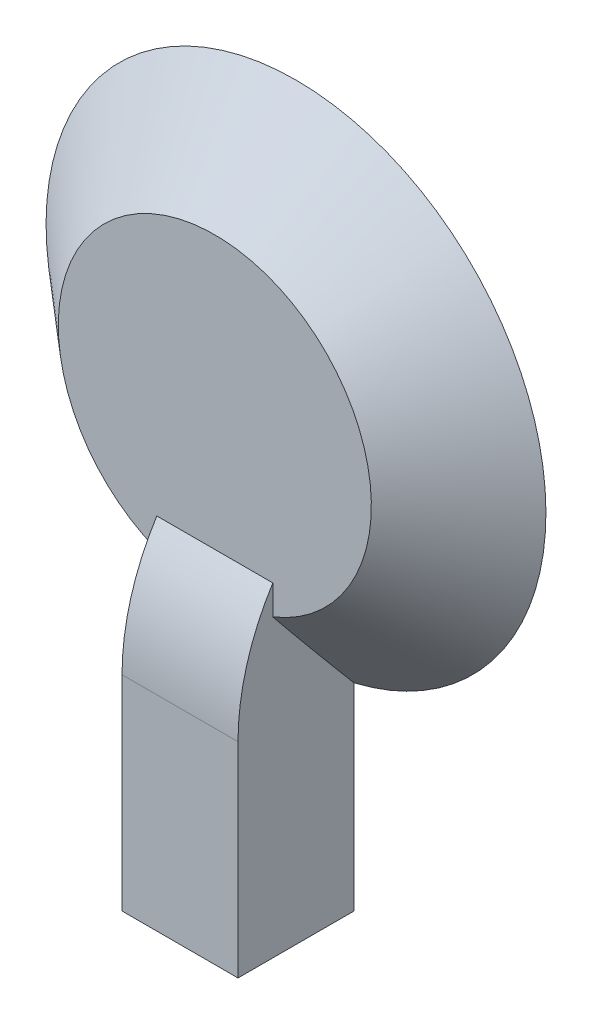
ISO-10303-21;
HEADER;
FILE_DESCRIPTION(('STEP AP214'),'2;1');
FILE_NAME('part.step','',(''),(''),'','','');
FILE_SCHEMA(('AUTOMOTIVE_DESIGN { 1 0 10303 214 1 1 1 1 }'));
ENDSEC;
DATA;
#1=APPLICATION_CONTEXT('core data for automotive mechanical design processes');
#2=APPLICATION_PROTOCOL_DEFINITION('international standard','automotive_design',2000,#1);
#3=PRODUCT_CONTEXT('',#1,'mechanical');
#4=PRODUCT('Part','Part','',(#3));
#5=PRODUCT_RELATED_PRODUCT_CATEGORY('part','',(#4));
#6=PRODUCT_DEFINITION_FORMATION('','',#4);
#7=PRODUCT_DEFINITION_CONTEXT('part definition',#1,'design');
#8=PRODUCT_DEFINITION('design','',#6,#7);
#9=PRODUCT_DEFINITION_SHAPE('','',#8);
#10=(LENGTH_UNIT() NAMED_UNIT(*) SI_UNIT(.MILLI.,.METRE.));
#11=(NAMED_UNIT(*) PLANE_ANGLE_UNIT() SI_UNIT($,.RADIAN.));
#12=(NAMED_UNIT(*) SI_UNIT($,.STERADIAN.) SOLID_ANGLE_UNIT());
#13=UNCERTAINTY_MEASURE_WITH_UNIT(LENGTH_MEASURE(1.E-05),#10,'distance_accuracy_value','');
#14=(GEOMETRIC_REPRESENTATION_CONTEXT(3) GLOBAL_UNCERTAINTY_ASSIGNED_CONTEXT((#13)) GLOBAL_UNIT_ASSIGNED_CONTEXT((#10,
#11,#12)) REPRESENTATION_CONTEXT('',''));
#15=CARTESIAN_POINT('',(0.,0.,0.));
#16=DIRECTION('',(0.,0.,1.));
#17=DIRECTION('',(1.,0.,0.));
#18=AXIS2_PLACEMENT_3D('',#15,#16,#17);
#19=CARTESIAN_POINT('',(0.,0.,1.778));
#20=DIRECTION('',(0.,0.,1.));
#21=DIRECTION('',(0.999999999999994,0.,0.));
#22=AXIS2_PLACEMENT_3D('',#19,#20,#21);
#23=PLANE('',#22);
#24=DIRECTION('',(0.,1.,0.));
#25=VECTOR('',#24,1.);
#26=CARTESIAN_POINT('',(1.26999999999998,-2.54,1.778));
#27=LINE('',#26,#25);
#28=CARTESIAN_POINT('',(1.26999999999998,-3.18413637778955,1.778));
#29=VERTEX_POINT('',#28);
#30=CARTESIAN_POINT('',(1.26999999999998,-2.54,1.778));
#31=VERTEX_POINT('',#30);
#32=EDGE_CURVE('E165',#29,#31,#27,.T.);
#33=ORIENTED_EDGE('',*,*,#32,.F.);
#34=CARTESIAN_POINT('',(0.,0.,1.778));
#35=DIRECTION('',(0.,0.,1.));
#36=DIRECTION('',(0.999999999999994,0.,0.));
#37=AXIS2_PLACEMENT_3D('',#34,#35,#36);
#38=CIRCLE('',#37,3.42806424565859);
#39=CARTESIAN_POINT('',(-1.26999999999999,-3.18413637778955,1.77799999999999));
#40=VERTEX_POINT('',#39);
#41=EDGE_CURVE('E172',#29,#40,#38,.T.);
#42=ORIENTED_EDGE('',*,*,#41,.T.);
#43=DIRECTION('',(0.,-1.,0.));
#44=VECTOR('',#43,1.);
#45=CARTESIAN_POINT('',(-1.27,-2.53999999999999,1.77799999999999));
#46=LINE('',#45,#44);
#47=CARTESIAN_POINT('',(-1.27,-2.53999999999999,1.77799999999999));
#48=VERTEX_POINT('',#47);
#49=EDGE_CURVE('E164',#48,#40,#46,.T.);
#50=ORIENTED_EDGE('',*,*,#49,.F.);
#51=DIRECTION('',(-0.999999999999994,0.,0.));
#52=VECTOR('',#51,1.);
#53=CARTESIAN_POINT('',(-1.27,-2.53999999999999,1.77799999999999));
#54=LINE('',#53,#52);
#55=EDGE_CURVE('E181',#31,#48,#54,.T.);
#56=ORIENTED_EDGE('',*,*,#55,.F.);
#57=EDGE_LOOP('',(#33,#42,#50,#56));
#58=FACE_BOUND('',#57,.T.);
#59=ADVANCED_FACE('F34',(#58),#23,.T.);
#60=CARTESIAN_POINT('',(0.,0.,0.));
#61=DIRECTION('',(0.,0.,1.));
#62=DIRECTION('',(0.999999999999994,0.,0.));
#63=AXIS2_PLACEMENT_3D('',#60,#61,#62);
#64=PLANE('',#63);
#65=DIRECTION('',(0.,-1.,0.));
#66=VECTOR('',#65,1.);
#67=CARTESIAN_POINT('',(-1.27,-2.53999999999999,0.));
#68=LINE('',#67,#66);
#69=CARTESIAN_POINT('',(-1.26999999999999,-5.32404156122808,0.));
#70=VERTEX_POINT('',#69);
#71=CARTESIAN_POINT('',(-1.26999999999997,-9.652,0.));
#72=VERTEX_POINT('',#71);
#73=EDGE_CURVE('E101',#70,#72,#68,.T.);
#74=ORIENTED_EDGE('',*,*,#73,.F.);
#75=CARTESIAN_POINT('',(0.,0.,0.));
#76=DIRECTION('',(0.,0.,1.));
#77=DIRECTION('',(0.999999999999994,0.,0.));
#78=AXIS2_PLACEMENT_3D('',#75,#76,#77);
#79=CIRCLE('',#78,5.47341927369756);
#80=CARTESIAN_POINT('',(1.26999999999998,-5.32404156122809,0.));
#81=VERTEX_POINT('',#80);
#82=EDGE_CURVE('E170',#70,#81,#79,.F.);
#83=ORIENTED_EDGE('',*,*,#82,.T.);
#84=DIRECTION('',(0.,1.,0.));
#85=VECTOR('',#84,1.);
#86=CARTESIAN_POINT('',(1.26999999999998,-2.54,0.));
#87=LINE('',#86,#85);
#88=CARTESIAN_POINT('',(1.27000000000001,-9.652,0.));
#89=VERTEX_POINT('',#88);
#90=EDGE_CURVE('E108',#89,#81,#87,.T.);
#91=ORIENTED_EDGE('',*,*,#90,.F.);
#92=DIRECTION('',(0.999999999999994,0.,0.));
#93=VECTOR('',#92,1.);
#94=CARTESIAN_POINT('',(1.27000000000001,-9.652,0.));
#95=LINE('',#94,#93);
#96=EDGE_CURVE('E93',#72,#89,#95,.T.);
#97=ORIENTED_EDGE('',*,*,#96,.F.);
#98=EDGE_LOOP('',(#74,#83,#91,#97));
#99=FACE_BOUND('',#98,.T.);
#100=CARTESIAN_POINT('',(0.,0.,0.));
#101=DIRECTION('',(0.,0.,-1.));
#102=DIRECTION('',(-0.999999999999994,0.,0.));
#103=AXIS2_PLACEMENT_3D('',#100,#101,#102);
#104=CIRCLE('',#103,1.651);
#105=CARTESIAN_POINT('',(-1.65099999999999,0.,0.));
#106=VERTEX_POINT('',#105);
#107=EDGE_CURVE('E167',#106,#106,#104,.T.);
#108=ORIENTED_EDGE('',*,*,#107,.F.);
#109=EDGE_LOOP('',(#108));
#110=FACE_BOUND('',#109,.T.);
#111=ADVANCED_FACE('F111',(#99,#110),#64,.F.);
#112=CARTESIAN_POINT('',(0.,0.,1.778));
#113=DIRECTION('',(0.,0.,-1.));
#114=DIRECTION('',(-0.999999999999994,0.,0.));
#115=AXIS2_PLACEMENT_3D('',#112,#113,#114);
#116=CONICAL_SURFACE('',#115,3.42806424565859,0.855211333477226);
#117=CARTESIAN_POINT('',(1.26999999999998,-9.42938091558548,-3.51287680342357));
#118=CARTESIAN_POINT('',(1.26999999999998,-9.06014458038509,-3.19481375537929));
#119=CARTESIAN_POINT('',(1.26999999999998,-8.69077719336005,-2.87690195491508));
#120=CARTESIAN_POINT('',(1.26999999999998,-7.95154702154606,-2.24163305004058));
#121=CARTESIAN_POINT('',(1.26999999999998,-7.58168422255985,-1.92427596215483));
#122=CARTESIAN_POINT('',(1.26999999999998,-6.84027577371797,-1.28955199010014));
#123=CARTESIAN_POINT('',(1.26999999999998,-6.46872825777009,-0.972187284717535));
#124=CARTESIAN_POINT('',(1.26999999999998,-5.72449302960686,-0.33881025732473));
#125=CARTESIAN_POINT('',(1.26999999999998,-5.35180534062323,-0.022797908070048));
#126=CARTESIAN_POINT('',(1.26999999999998,-4.75913808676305,0.476399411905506));
#127=CARTESIAN_POINT('',(1.26999999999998,-4.53983909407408,0.660391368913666));
#128=CARTESIAN_POINT('',(1.26999999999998,-4.10015351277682,1.02708992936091));
#129=CARTESIAN_POINT('',(1.26999999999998,-3.87976688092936,1.20979648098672));
#130=CARTESIAN_POINT('',(1.26999999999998,-3.43756948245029,1.57295888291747));
#131=CARTESIAN_POINT('',(1.26999999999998,-3.21576068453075,1.75341711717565));
#132=CARTESIAN_POINT('',(1.26999999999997,-2.88087055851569,2.02137964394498));
#133=CARTESIAN_POINT('',(1.26999999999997,-2.76887956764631,2.11024489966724));
#134=CARTESIAN_POINT('',(1.26999999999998,-2.54389693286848,2.28669785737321));
#135=CARTESIAN_POINT('',(1.26999999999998,-2.4309053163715,2.37428559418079));
#136=CARTESIAN_POINT('',(1.26999999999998,-2.24021925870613,2.51964237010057));
#137=CARTESIAN_POINT('',(1.26999999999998,-2.16290529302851,2.57790976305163));
#138=CARTESIAN_POINT('',(1.26999999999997,-2.007453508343,2.69332215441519));
#139=CARTESIAN_POINT('',(1.26999999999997,-1.92931576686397,2.75046725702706));
#140=CARTESIAN_POINT('',(1.26999999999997,-1.77190200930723,2.86329533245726));
#141=CARTESIAN_POINT('',(1.26999999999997,-1.69262523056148,2.9189772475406));
#142=CARTESIAN_POINT('',(1.26999999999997,-1.57262014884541,3.00093090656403));
#143=CARTESIAN_POINT('',(1.26999999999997,-1.53243073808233,3.02799116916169));
#144=CARTESIAN_POINT('',(1.26999999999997,-1.45162781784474,3.08147693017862));
#145=CARTESIAN_POINT('',(1.26999999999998,-1.4110142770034,3.10790238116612));
#146=CARTESIAN_POINT('',(1.26999999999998,-1.37015938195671,3.13395406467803));
#147=B_SPLINE_CURVE_WITH_KNOTS('',3,(#117,#118,#119,#120,#121,#122,#123,#124,#125,#126,#127,
#128,#129,#130,#131,#132,#133,#134,#135,#136,#137,#138,#139,#140,#141,#142,#143,#144,#145,#146),
.UNSPECIFIED.,.F.,.F.,(4,2,2,2,2,2,2,2,2,2,2,2,2,2,4),(0.,1.4620187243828,2.92408028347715,
4.3899953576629,5.85588075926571,6.71465876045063,7.5734711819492,8.43127844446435,
8.86016787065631,9.28904558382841,9.57947365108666,9.86987462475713,10.1604800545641,
10.3058260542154,10.4511828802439),.UNSPECIFIED.);
#148=EDGE_CURVE('E114',#81,#29,#147,.T.);
#149=ORIENTED_EDGE('',*,*,#148,.F.);
#150=ORIENTED_EDGE('',*,*,#82,.F.);
#151=CARTESIAN_POINT('',(-1.26999999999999,-9.42938091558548,-3.51287680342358));
#152=CARTESIAN_POINT('',(-1.26999999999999,-9.0601445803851,-3.19481375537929));
#153=CARTESIAN_POINT('',(-1.26999999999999,-8.69077719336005,-2.87690195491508));
#154=CARTESIAN_POINT('',(-1.26999999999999,-7.95154702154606,-2.24163305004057));
#155=CARTESIAN_POINT('',(-1.26999999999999,-7.58168422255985,-1.92427596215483));
#156=CARTESIAN_POINT('',(-1.27,-6.84027577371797,-1.28955199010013));
#157=CARTESIAN_POINT('',(-1.27,-6.4687282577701,-0.972187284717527));
#158=CARTESIAN_POINT('',(-1.27,-5.72449302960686,-0.338810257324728));
#159=CARTESIAN_POINT('',(-1.26999999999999,-5.35180534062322,-0.0227979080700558));
#160=CARTESIAN_POINT('',(-1.26999999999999,-4.75913808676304,0.476399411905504));
#161=CARTESIAN_POINT('',(-1.27,-4.53983909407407,0.66039136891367));
#162=CARTESIAN_POINT('',(-1.27,-4.10015351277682,1.02708992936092));
#163=CARTESIAN_POINT('',(-1.27,-3.87976688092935,1.20979648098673));
#164=CARTESIAN_POINT('',(-1.27,-3.43756948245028,1.57295888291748));
#165=CARTESIAN_POINT('',(-1.27,-3.21576068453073,1.75341711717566));
#166=CARTESIAN_POINT('',(-1.27,-2.88087055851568,2.02137964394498));
#167=CARTESIAN_POINT('',(-1.27,-2.7688795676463,2.11024489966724));
#168=CARTESIAN_POINT('',(-1.27,-2.54389693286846,2.28669785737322));
#169=CARTESIAN_POINT('',(-1.26999999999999,-2.43090531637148,2.37428559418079));
#170=CARTESIAN_POINT('',(-1.27,-2.24021925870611,2.51964237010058));
#171=CARTESIAN_POINT('',(-1.27,-2.16290529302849,2.57790976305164));
#172=CARTESIAN_POINT('',(-1.27,-2.00745350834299,2.69332215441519));
#173=CARTESIAN_POINT('',(-1.27,-1.92931576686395,2.75046725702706));
#174=CARTESIAN_POINT('',(-1.27,-1.77190200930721,2.86329533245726));
#175=CARTESIAN_POINT('',(-1.27,-1.69262523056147,2.9189772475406));
#176=CARTESIAN_POINT('',(-1.27,-1.5726201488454,3.00093090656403));
#177=CARTESIAN_POINT('',(-1.27,-1.53243073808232,3.02799116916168));
#178=CARTESIAN_POINT('',(-1.27,-1.45162781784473,3.08147693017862));
#179=CARTESIAN_POINT('',(-1.27,-1.41101427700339,3.10790238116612));
#180=CARTESIAN_POINT('',(-1.26999999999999,-1.3701593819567,3.13395406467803));
#181=B_SPLINE_CURVE_WITH_KNOTS('',3,(#151,#152,#153,#154,#155,#156,#157,#158,#159,#160,#161,
#162,#163,#164,#165,#166,#167,#168,#169,#170,#171,#172,#173,#174,#175,#176,#177,#178,#179,#180),
.UNSPECIFIED.,.F.,.F.,(4,2,2,2,2,2,2,2,2,2,2,2,2,2,4),(0.,1.4620187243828,2.92408028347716,
4.38999535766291,5.85588075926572,6.71465876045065,7.57347118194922,8.43127844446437,
8.86016787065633,9.28904558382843,9.57947365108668,9.86987462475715,10.1604800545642,
10.3058260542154,10.4511828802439),.UNSPECIFIED.);
#182=EDGE_CURVE('E104',#40,#70,#181,.F.);
#183=ORIENTED_EDGE('',*,*,#182,.F.);
#184=ORIENTED_EDGE('',*,*,#41,.F.);
#185=EDGE_LOOP('',(#149,#150,#183,#184));
#186=FACE_BOUND('',#185,.T.);
#187=ADVANCED_FACE('F128',(#186),#116,.T.);
#188=CARTESIAN_POINT('',(0.,0.,-2.54));
#189=DIRECTION('',(0.,0.,1.));
#190=DIRECTION('',(0.999999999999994,0.,0.));
#191=AXIS2_PLACEMENT_3D('',#188,#189,#190);
#192=CYLINDRICAL_SURFACE('',#191,1.651);
#193=CARTESIAN_POINT('',(0.,0.,-2.54));
#194=DIRECTION('',(0.,0.,-1.));
#195=DIRECTION('',(-0.999999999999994,0.,0.));
#196=AXIS2_PLACEMENT_3D('',#193,#194,#195);
#197=CIRCLE('',#196,1.651);
#198=CARTESIAN_POINT('',(-1.65099999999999,0.,-2.54));
#199=VERTEX_POINT('',#198);
#200=EDGE_CURVE('E97',#199,#199,#197,.T.);
#201=ORIENTED_EDGE('',*,*,#200,.F.);
#202=EDGE_LOOP('',(#201));
#203=FACE_BOUND('',#202,.T.);
#204=ORIENTED_EDGE('',*,*,#107,.T.);
#205=EDGE_LOOP('',(#204));
#206=FACE_BOUND('',#205,.T.);
#207=ADVANCED_FACE('F132',(#203,#206),#192,.T.);
#208=CARTESIAN_POINT('',(0.,0.,-2.54));
#209=DIRECTION('',(0.,0.,-1.));
#210=DIRECTION('',(-0.999999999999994,0.,0.));
#211=AXIS2_PLACEMENT_3D('',#208,#209,#210);
#212=PLANE('',#211);
#213=ORIENTED_EDGE('',*,*,#200,.T.);
#214=EDGE_LOOP('',(#213));
#215=FACE_BOUND('',#214,.T.);
#216=ADVANCED_FACE('F142',(#215),#212,.T.);
#217=CARTESIAN_POINT('',(1.26999999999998,-2.54,2.54));
#218=DIRECTION('',(-0.999999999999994,0.,0.));
#219=DIRECTION('',(0.,-1.,0.));
#220=AXIS2_PLACEMENT_3D('',#217,#218,#219);
#221=PLANE('',#220);
#222=ORIENTED_EDGE('',*,*,#32,.T.);
#223=CARTESIAN_POINT('',(1.26999999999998,-5.17010189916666,-2.38));
#224=DIRECTION('',(-0.999999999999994,0.,0.));
#225=DIRECTION('',(0.,-1.,0.));
#226=AXIS2_PLACEMENT_3D('',#223,#224,#225);
#227=CIRCLE('',#226,4.92);
#228=CARTESIAN_POINT('',(1.26999999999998,-5.17010189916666,2.53999999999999));
#229=VERTEX_POINT('',#228);
#230=EDGE_CURVE('E11',#31,#229,#227,.F.);
#231=ORIENTED_EDGE('',*,*,#230,.T.);
#232=DIRECTION('',(0.,1.,0.));
#233=VECTOR('',#232,1.);
#234=CARTESIAN_POINT('',(1.26999999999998,-2.54,2.54));
#235=LINE('',#234,#233);
#236=CARTESIAN_POINT('',(1.27000000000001,-9.652,2.53999999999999));
#237=VERTEX_POINT('',#236);
#238=EDGE_CURVE('E161',#237,#229,#235,.T.);
#239=ORIENTED_EDGE('',*,*,#238,.F.);
#240=DIRECTION('',(0.,0.,-1.));
#241=VECTOR('',#240,1.);
#242=CARTESIAN_POINT('',(1.27000000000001,-9.652,2.53999999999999));
#243=LINE('',#242,#241);
#244=EDGE_CURVE('E98',#237,#89,#243,.T.);
#245=ORIENTED_EDGE('',*,*,#244,.T.);
#246=ORIENTED_EDGE('',*,*,#90,.T.);
#247=ORIENTED_EDGE('',*,*,#148,.T.);
#248=EDGE_LOOP('',(#222,#231,#239,#245,#246,#247));
#249=FACE_BOUND('',#248,.T.);
#250=ADVANCED_FACE('F146',(#249),#221,.F.);
#251=CARTESIAN_POINT('',(-1.27,-2.53999999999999,2.53999999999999));
#252=DIRECTION('',(0.999999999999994,0.,0.));
#253=DIRECTION('',(0.,1.,0.));
#254=AXIS2_PLACEMENT_3D('',#251,#252,#253);
#255=PLANE('',#254);
#256=DIRECTION('',(0.,-1.,0.));
#257=VECTOR('',#256,1.);
#258=CARTESIAN_POINT('',(-1.27,-2.53999999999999,2.53999999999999));
#259=LINE('',#258,#257);
#260=CARTESIAN_POINT('',(-1.26999999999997,-5.17010189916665,2.53999999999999));
#261=VERTEX_POINT('',#260);
#262=CARTESIAN_POINT('',(-1.26999999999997,-9.652,2.53999999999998));
#263=VERTEX_POINT('',#262);
#264=EDGE_CURVE('E163',#261,#263,#259,.T.);
#265=ORIENTED_EDGE('',*,*,#264,.F.);
#266=CARTESIAN_POINT('',(-1.27,-5.17010189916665,-2.38000000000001));
#267=DIRECTION('',(0.999999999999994,0.,0.));
#268=DIRECTION('',(0.,1.,0.));
#269=AXIS2_PLACEMENT_3D('',#266,#267,#268);
#270=CIRCLE('',#269,4.92);
#271=EDGE_CURVE('E42',#261,#48,#270,.F.);
#272=ORIENTED_EDGE('',*,*,#271,.T.);
#273=ORIENTED_EDGE('',*,*,#49,.T.);
#274=ORIENTED_EDGE('',*,*,#182,.T.);
#275=ORIENTED_EDGE('',*,*,#73,.T.);
#276=DIRECTION('',(0.,0.,-1.));
#277=VECTOR('',#276,1.);
#278=CARTESIAN_POINT('',(-1.26999999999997,-9.652,2.53999999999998));
#279=LINE('',#278,#277);
#280=EDGE_CURVE('E88',#263,#72,#279,.T.);
#281=ORIENTED_EDGE('',*,*,#280,.F.);
#282=EDGE_LOOP('',(#265,#272,#273,#274,#275,#281));
#283=FACE_BOUND('',#282,.T.);
#284=ADVANCED_FACE('F102',(#283),#255,.F.);
#285=CARTESIAN_POINT('',(1.27000000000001,-9.652,2.53999999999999));
#286=DIRECTION('',(0.,1.,0.));
#287=DIRECTION('',(0.,0.,1.));
#288=AXIS2_PLACEMENT_3D('',#285,#286,#287);
#289=PLANE('',#288);
#290=ORIENTED_EDGE('',*,*,#280,.T.);
#291=ORIENTED_EDGE('',*,*,#96,.T.);
#292=ORIENTED_EDGE('',*,*,#244,.F.);
#293=DIRECTION('',(0.999999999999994,0.,0.));
#294=VECTOR('',#293,1.);
#295=CARTESIAN_POINT('',(1.27000000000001,-9.652,2.53999999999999));
#296=LINE('',#295,#294);
#297=EDGE_CURVE('E94',#263,#237,#296,.T.);
#298=ORIENTED_EDGE('',*,*,#297,.F.);
#299=EDGE_LOOP('',(#290,#291,#292,#298));
#300=FACE_BOUND('',#299,.T.);
#301=ADVANCED_FACE('F90',(#300),#289,.F.);
#302=CARTESIAN_POINT('',(0.,0.,2.54));
#303=DIRECTION('',(0.,0.,-1.));
#304=DIRECTION('',(-0.999999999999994,0.,0.));
#305=AXIS2_PLACEMENT_3D('',#302,#303,#304);
#306=PLANE('',#305);
#307=ORIENTED_EDGE('',*,*,#238,.T.);
#308=DIRECTION('',(-0.999999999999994,0.,0.));
#309=VECTOR('',#308,1.);
#310=CARTESIAN_POINT('',(0.,-5.17010189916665,2.53999999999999));
#311=LINE('',#310,#309);
#312=EDGE_CURVE('E162',#229,#261,#311,.T.);
#313=ORIENTED_EDGE('',*,*,#312,.T.);
#314=ORIENTED_EDGE('',*,*,#264,.T.);
#315=ORIENTED_EDGE('',*,*,#297,.T.);
#316=EDGE_LOOP('',(#307,#313,#314,#315));
#317=FACE_BOUND('',#316,.T.);
#318=ADVANCED_FACE('F154',(#317),#306,.F.);
#319=CARTESIAN_POINT('',(-1.27,-5.17010189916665,-2.38000000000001));
#320=DIRECTION('',(-0.999999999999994,0.,0.));
#321=DIRECTION('',(0.,-1.,0.));
#322=AXIS2_PLACEMENT_3D('',#319,#320,#321);
#323=CYLINDRICAL_SURFACE('',#322,4.92);
#324=ORIENTED_EDGE('',*,*,#230,.F.);
#325=ORIENTED_EDGE('',*,*,#55,.T.);
#326=ORIENTED_EDGE('',*,*,#271,.F.);
#327=ORIENTED_EDGE('',*,*,#312,.F.);
#328=EDGE_LOOP('',(#324,#325,#326,#327));
#329=FACE_BOUND('',#328,.T.);
#330=ADVANCED_FACE('F36',(#329),#323,.T.);
#331=CLOSED_SHELL('',(#59,#111,#187,#207,#216,#250,#284,#301,#318,#330));
#332=MANIFOLD_SOLID_BREP('B2',#331);
#333=ADVANCED_BREP_SHAPE_REPRESENTATION('',(#18,#332),#14);
#334=SHAPE_DEFINITION_REPRESENTATION(#9,#333);
ENDSEC;
END-ISO-10303-21;
